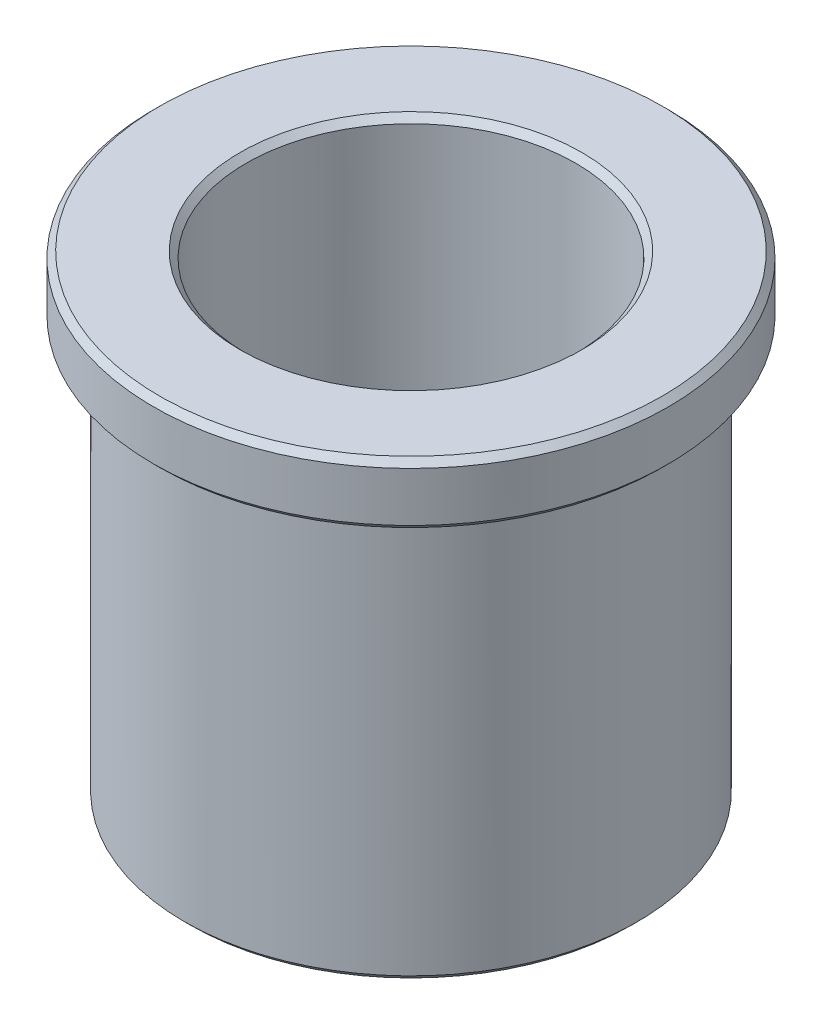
ISO-10303-21;
HEADER;
FILE_DESCRIPTION(('STEP AP214'),'2;1');
FILE_NAME('part.step','',(''),(''),'','','');
FILE_SCHEMA(('AUTOMOTIVE_DESIGN { 1 0 10303 214 1 1 1 1 }'));
ENDSEC;
DATA;
#1=APPLICATION_CONTEXT('core data for automotive mechanical design processes');
#2=APPLICATION_PROTOCOL_DEFINITION('international standard','automotive_design',2000,#1);
#3=PRODUCT_CONTEXT('',#1,'mechanical');
#4=PRODUCT('Part','Part','',(#3));
#5=PRODUCT_RELATED_PRODUCT_CATEGORY('part','',(#4));
#6=PRODUCT_DEFINITION_FORMATION('','',#4);
#7=PRODUCT_DEFINITION_CONTEXT('part definition',#1,'design');
#8=PRODUCT_DEFINITION('design','',#6,#7);
#9=PRODUCT_DEFINITION_SHAPE('','',#8);
#10=(LENGTH_UNIT() NAMED_UNIT(*) SI_UNIT(.MILLI.,.METRE.));
#11=(NAMED_UNIT(*) PLANE_ANGLE_UNIT() SI_UNIT($,.RADIAN.));
#12=(NAMED_UNIT(*) SI_UNIT($,.STERADIAN.) SOLID_ANGLE_UNIT());
#13=UNCERTAINTY_MEASURE_WITH_UNIT(LENGTH_MEASURE(1.E-05),#10,'distance_accuracy_value','');
#14=(GEOMETRIC_REPRESENTATION_CONTEXT(3) GLOBAL_UNCERTAINTY_ASSIGNED_CONTEXT((#13)) GLOBAL_UNIT_ASSIGNED_CONTEXT((#10,
#11,#12)) REPRESENTATION_CONTEXT('',''));
#15=CARTESIAN_POINT('',(0.,0.,0.));
#16=DIRECTION('',(0.,0.,1.));
#17=DIRECTION('',(1.,0.,0.));
#18=AXIS2_PLACEMENT_3D('',#15,#16,#17);
#19=CARTESIAN_POINT('',(0.,23.,0.));
#20=DIRECTION('',(0.,1.,0.));
#21=DIRECTION('',(0.,0.,1.));
#22=AXIS2_PLACEMENT_3D('',#19,#20,#21);
#23=PLANE('',#22);
#24=CARTESIAN_POINT('',(0.,23.,0.));
#25=DIRECTION('',(0.,-1.,0.));
#26=DIRECTION('',(1.,0.,0.));
#27=AXIS2_PLACEMENT_3D('',#24,#25,#26);
#28=CIRCLE('',#27,12.2);
#29=CARTESIAN_POINT('',(12.2,23.,0.));
#30=VERTEX_POINT('',#29);
#31=EDGE_CURVE('E42',#30,#30,#28,.T.);
#32=ORIENTED_EDGE('',*,*,#31,.F.);
#33=EDGE_LOOP('',(#32));
#34=FACE_BOUND('',#33,.T.);
#35=CARTESIAN_POINT('',(0.,23.,0.));
#36=DIRECTION('',(0.,1.,0.));
#37=DIRECTION('',(0.,0.,1.));
#38=AXIS2_PLACEMENT_3D('',#35,#36,#37);
#39=CIRCLE('',#38,8.3);
#40=CARTESIAN_POINT('',(0.,23.,8.3));
#41=VERTEX_POINT('',#40);
#42=EDGE_CURVE('E18',#41,#41,#39,.F.);
#43=ORIENTED_EDGE('',*,*,#42,.T.);
#44=EDGE_LOOP('',(#43));
#45=FACE_BOUND('',#44,.T.);
#46=ADVANCED_FACE('F15',(#34,#45),#23,.T.);
#47=CARTESIAN_POINT('',(0.,23.,0.));
#48=DIRECTION('',(0.,1.,0.));
#49=DIRECTION('',(0.,0.,1.));
#50=AXIS2_PLACEMENT_3D('',#47,#48,#49);
#51=CONICAL_SURFACE('',#50,8.3,0.785398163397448);
#52=ORIENTED_EDGE('',*,*,#42,.F.);
#53=EDGE_LOOP('',(#52));
#54=FACE_BOUND('',#53,.T.);
#55=CARTESIAN_POINT('',(0.,22.7,0.));
#56=DIRECTION('',(0.,-1.,0.));
#57=DIRECTION('',(0.,0.,-1.));
#58=AXIS2_PLACEMENT_3D('',#55,#56,#57);
#59=CIRCLE('',#58,8.);
#60=CARTESIAN_POINT('',(0.,22.7,-8.));
#61=VERTEX_POINT('',#60);
#62=EDGE_CURVE('E40',#61,#61,#59,.T.);
#63=ORIENTED_EDGE('',*,*,#62,.T.);
#64=EDGE_LOOP('',(#63));
#65=FACE_BOUND('',#64,.T.);
#66=ADVANCED_FACE('F57',(#54,#65),#51,.F.);
#67=CARTESIAN_POINT('',(0.,22.7,0.));
#68=DIRECTION('',(0.,-1.,0.));
#69=DIRECTION('',(1.,0.,0.));
#70=AXIS2_PLACEMENT_3D('',#67,#68,#69);
#71=CONICAL_SURFACE('',#70,12.5,0.785398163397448);
#72=ORIENTED_EDGE('',*,*,#31,.T.);
#73=EDGE_LOOP('',(#72));
#74=FACE_BOUND('',#73,.T.);
#75=CARTESIAN_POINT('',(0.,22.7,0.));
#76=DIRECTION('',(0.,-1.,0.));
#77=DIRECTION('',(0.,0.,-1.));
#78=AXIS2_PLACEMENT_3D('',#75,#76,#77);
#79=CIRCLE('',#78,12.5);
#80=CARTESIAN_POINT('',(0.,22.7,-12.5));
#81=VERTEX_POINT('',#80);
#82=EDGE_CURVE('E37',#81,#81,#79,.T.);
#83=ORIENTED_EDGE('',*,*,#82,.F.);
#84=EDGE_LOOP('',(#83));
#85=FACE_BOUND('',#84,.T.);
#86=ADVANCED_FACE('F60',(#74,#85),#71,.T.);
#87=CARTESIAN_POINT('',(0.,20.,0.));
#88=DIRECTION('',(0.,-1.,0.));
#89=DIRECTION('',(0.,0.,-1.));
#90=AXIS2_PLACEMENT_3D('',#87,#88,#89);
#91=CYLINDRICAL_SURFACE('',#90,8.);
#92=CARTESIAN_POINT('',(0.,0.300000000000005,0.));
#93=DIRECTION('',(0.,-1.,0.));
#94=DIRECTION('',(0.,0.,-1.));
#95=AXIS2_PLACEMENT_3D('',#92,#93,#94);
#96=CIRCLE('',#95,8.);
#97=CARTESIAN_POINT('',(0.,0.300000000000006,-8.));
#98=VERTEX_POINT('',#97);
#99=EDGE_CURVE('E34',#98,#98,#96,.T.);
#100=ORIENTED_EDGE('',*,*,#99,.T.);
#101=EDGE_LOOP('',(#100));
#102=FACE_BOUND('',#101,.T.);
#103=ORIENTED_EDGE('',*,*,#62,.F.);
#104=EDGE_LOOP('',(#103));
#105=FACE_BOUND('',#104,.T.);
#106=ADVANCED_FACE('F63',(#102,#105),#91,.F.);
#107=CARTESIAN_POINT('',(0.,23.,0.));
#108=DIRECTION('',(0.,-1.,0.));
#109=DIRECTION('',(0.,0.,-1.));
#110=AXIS2_PLACEMENT_3D('',#107,#108,#109);
#111=CYLINDRICAL_SURFACE('',#110,12.5);
#112=ORIENTED_EDGE('',*,*,#82,.T.);
#113=EDGE_LOOP('',(#112));
#114=FACE_BOUND('',#113,.T.);
#115=CARTESIAN_POINT('',(0.,20.3,0.));
#116=DIRECTION('',(0.,1.,0.));
#117=DIRECTION('',(0.,0.,1.));
#118=AXIS2_PLACEMENT_3D('',#115,#116,#117);
#119=CIRCLE('',#118,12.5);
#120=CARTESIAN_POINT('',(0.,20.3,12.5));
#121=VERTEX_POINT('',#120);
#122=EDGE_CURVE('E30',#121,#121,#119,.F.);
#123=ORIENTED_EDGE('',*,*,#122,.F.);
#124=EDGE_LOOP('',(#123));
#125=FACE_BOUND('',#124,.T.);
#126=ADVANCED_FACE('F65',(#114,#125),#111,.T.);
#127=CARTESIAN_POINT('',(0.,0.,0.));
#128=DIRECTION('',(0.,-1.,0.));
#129=DIRECTION('',(0.,0.,-1.));
#130=AXIS2_PLACEMENT_3D('',#127,#128,#129);
#131=CONICAL_SURFACE('',#130,8.3,0.785398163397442);
#132=CARTESIAN_POINT('',(0.,0.,0.));
#133=DIRECTION('',(0.,-1.,0.));
#134=DIRECTION('',(0.,0.,-1.));
#135=AXIS2_PLACEMENT_3D('',#132,#133,#134);
#136=CIRCLE('',#135,8.3);
#137=CARTESIAN_POINT('',(0.,0.,-8.3));
#138=VERTEX_POINT('',#137);
#139=EDGE_CURVE('E33',#138,#138,#136,.T.);
#140=ORIENTED_EDGE('',*,*,#139,.T.);
#141=EDGE_LOOP('',(#140));
#142=FACE_BOUND('',#141,.T.);
#143=ORIENTED_EDGE('',*,*,#99,.F.);
#144=EDGE_LOOP('',(#143));
#145=FACE_BOUND('',#144,.T.);
#146=ADVANCED_FACE('F73',(#142,#145),#131,.F.);
#147=CARTESIAN_POINT('',(0.,20.3,0.));
#148=DIRECTION('',(0.,1.,0.));
#149=DIRECTION('',(0.,0.,1.));
#150=AXIS2_PLACEMENT_3D('',#147,#148,#149);
#151=CONICAL_SURFACE('',#150,12.5,0.785398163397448);
#152=CARTESIAN_POINT('',(0.,20.,0.));
#153=DIRECTION('',(0.,1.,0.));
#154=DIRECTION('',(0.,0.,1.));
#155=AXIS2_PLACEMENT_3D('',#152,#153,#154);
#156=CIRCLE('',#155,12.2);
#157=CARTESIAN_POINT('',(0.,20.,12.2));
#158=VERTEX_POINT('',#157);
#159=EDGE_CURVE('E46',#158,#158,#156,.T.);
#160=ORIENTED_EDGE('',*,*,#159,.T.);
#161=EDGE_LOOP('',(#160));
#162=FACE_BOUND('',#161,.T.);
#163=ORIENTED_EDGE('',*,*,#122,.T.);
#164=EDGE_LOOP('',(#163));
#165=FACE_BOUND('',#164,.T.);
#166=ADVANCED_FACE('F95',(#162,#165),#151,.T.);
#167=CARTESIAN_POINT('',(0.,0.,0.));
#168=DIRECTION('',(0.,1.,0.));
#169=DIRECTION('',(0.,0.,1.));
#170=AXIS2_PLACEMENT_3D('',#167,#168,#169);
#171=PLANE('',#170);
#172=CARTESIAN_POINT('',(0.,0.,0.));
#173=DIRECTION('',(0.,1.,0.));
#174=DIRECTION('',(0.,0.,1.));
#175=AXIS2_PLACEMENT_3D('',#172,#173,#174);
#176=CIRCLE('',#175,10.7);
#177=CARTESIAN_POINT('',(0.,0.,10.7));
#178=VERTEX_POINT('',#177);
#179=EDGE_CURVE('E27',#178,#178,#176,.T.);
#180=ORIENTED_EDGE('',*,*,#179,.F.);
#181=EDGE_LOOP('',(#180));
#182=FACE_BOUND('',#181,.T.);
#183=ORIENTED_EDGE('',*,*,#139,.F.);
#184=EDGE_LOOP('',(#183));
#185=FACE_BOUND('',#184,.T.);
#186=ADVANCED_FACE('F91',(#182,#185),#171,.F.);
#187=CARTESIAN_POINT('',(0.,20.,0.));
#188=DIRECTION('',(0.,1.,0.));
#189=DIRECTION('',(0.,0.,1.));
#190=AXIS2_PLACEMENT_3D('',#187,#188,#189);
#191=PLANE('',#190);
#192=CARTESIAN_POINT('',(0.,20.,0.));
#193=DIRECTION('',(0.,-1.,0.));
#194=DIRECTION('',(0.,0.,-1.));
#195=AXIS2_PLACEMENT_3D('',#192,#193,#194);
#196=CIRCLE('',#195,11.);
#197=CARTESIAN_POINT('',(0.,20.,-11.));
#198=VERTEX_POINT('',#197);
#199=EDGE_CURVE('E22',#198,#198,#196,.T.);
#200=ORIENTED_EDGE('',*,*,#199,.F.);
#201=EDGE_LOOP('',(#200));
#202=FACE_BOUND('',#201,.T.);
#203=ORIENTED_EDGE('',*,*,#159,.F.);
#204=EDGE_LOOP('',(#203));
#205=FACE_BOUND('',#204,.T.);
#206=ADVANCED_FACE('F84',(#202,#205),#191,.F.);
#207=CARTESIAN_POINT('',(0.,0.299999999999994,0.));
#208=DIRECTION('',(0.,1.,0.));
#209=DIRECTION('',(0.,0.,1.));
#210=AXIS2_PLACEMENT_3D('',#207,#208,#209);
#211=CONICAL_SURFACE('',#210,11.,0.785398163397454);
#212=CARTESIAN_POINT('',(0.,0.299999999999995,0.));
#213=DIRECTION('',(0.,-1.,0.));
#214=DIRECTION('',(0.,0.,-1.));
#215=AXIS2_PLACEMENT_3D('',#212,#213,#214);
#216=CIRCLE('',#215,11.);
#217=CARTESIAN_POINT('',(0.,0.299999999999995,-11.));
#218=VERTEX_POINT('',#217);
#219=EDGE_CURVE('E10',#218,#218,#216,.F.);
#220=ORIENTED_EDGE('',*,*,#219,.F.);
#221=EDGE_LOOP('',(#220));
#222=FACE_BOUND('',#221,.T.);
#223=ORIENTED_EDGE('',*,*,#179,.T.);
#224=EDGE_LOOP('',(#223));
#225=FACE_BOUND('',#224,.T.);
#226=ADVANCED_FACE('F79',(#222,#225),#211,.T.);
#227=CARTESIAN_POINT('',(0.,20.,0.));
#228=DIRECTION('',(0.,-1.,0.));
#229=DIRECTION('',(0.,0.,-1.));
#230=AXIS2_PLACEMENT_3D('',#227,#228,#229);
#231=CYLINDRICAL_SURFACE('',#230,11.);
#232=ORIENTED_EDGE('',*,*,#219,.T.);
#233=EDGE_LOOP('',(#232));
#234=FACE_BOUND('',#233,.T.);
#235=ORIENTED_EDGE('',*,*,#199,.T.);
#236=EDGE_LOOP('',(#235));
#237=FACE_BOUND('',#236,.T.);
#238=ADVANCED_FACE('F77',(#234,#237),#231,.T.);
#239=CLOSED_SHELL('',(#46,#66,#86,#106,#126,#146,#166,#186,#206,#226,#238));
#240=MANIFOLD_SOLID_BREP('B1',#239);
#241=ADVANCED_BREP_SHAPE_REPRESENTATION('',(#18,#240),#14);
#242=SHAPE_DEFINITION_REPRESENTATION(#9,#241);
ENDSEC;
END-ISO-10303-21;
